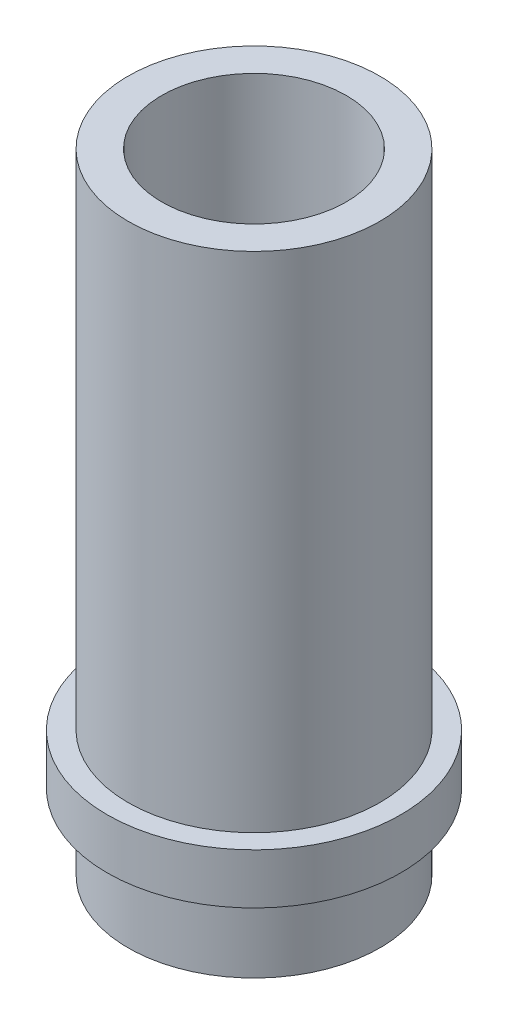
ISO-10303-21;
HEADER;
FILE_DESCRIPTION(('STEP AP214'),'2;1');
FILE_NAME('part.step','',(''),(''),'','','');
FILE_SCHEMA(('AUTOMOTIVE_DESIGN { 1 0 10303 214 1 1 1 1 }'));
ENDSEC;
DATA;
#1=APPLICATION_CONTEXT('core data for automotive mechanical design processes');
#2=APPLICATION_PROTOCOL_DEFINITION('international standard','automotive_design',2000,#1);
#3=PRODUCT_CONTEXT('',#1,'mechanical');
#4=PRODUCT('Part','Part','',(#3));
#5=PRODUCT_RELATED_PRODUCT_CATEGORY('part','',(#4));
#6=PRODUCT_DEFINITION_FORMATION('','',#4);
#7=PRODUCT_DEFINITION_CONTEXT('part definition',#1,'design');
#8=PRODUCT_DEFINITION('design','',#6,#7);
#9=PRODUCT_DEFINITION_SHAPE('','',#8);
#10=(LENGTH_UNIT() NAMED_UNIT(*) SI_UNIT(.MILLI.,.METRE.));
#11=(NAMED_UNIT(*) PLANE_ANGLE_UNIT() SI_UNIT($,.RADIAN.));
#12=(NAMED_UNIT(*) SI_UNIT($,.STERADIAN.) SOLID_ANGLE_UNIT());
#13=UNCERTAINTY_MEASURE_WITH_UNIT(LENGTH_MEASURE(1.E-05),#10,'distance_accuracy_value','');
#14=(GEOMETRIC_REPRESENTATION_CONTEXT(3) GLOBAL_UNCERTAINTY_ASSIGNED_CONTEXT((#13)) GLOBAL_UNIT_ASSIGNED_CONTEXT((#10,
#11,#12)) REPRESENTATION_CONTEXT('',''));
#15=CARTESIAN_POINT('',(0.,0.,0.));
#16=DIRECTION('',(0.,0.,1.));
#17=DIRECTION('',(1.,0.,0.));
#18=AXIS2_PLACEMENT_3D('',#15,#16,#17);
#19=CARTESIAN_POINT('',(-99.,0.,214.));
#20=DIRECTION('',(0.,-1.,0.));
#21=DIRECTION('',(0.,0.,-1.));
#22=AXIS2_PLACEMENT_3D('',#19,#20,#21);
#23=CYLINDRICAL_SURFACE('',#22,11.);
#24=CARTESIAN_POINT('',(-99.,0.,214.));
#25=DIRECTION('',(0.,-1.,0.));
#26=DIRECTION('',(0.,0.,-1.));
#27=AXIS2_PLACEMENT_3D('',#24,#25,#26);
#28=CIRCLE('',#27,11.);
#29=CARTESIAN_POINT('',(-99.,0.,203.));
#30=VERTEX_POINT('',#29);
#31=EDGE_CURVE('E26',#30,#30,#28,.T.);
#32=ORIENTED_EDGE('',*,*,#31,.F.);
#33=EDGE_LOOP('',(#32));
#34=FACE_BOUND('',#33,.T.);
#35=CARTESIAN_POINT('',(-99.,-75.,214.));
#36=DIRECTION('',(0.,-1.,0.));
#37=DIRECTION('',(0.,0.,-1.));
#38=AXIS2_PLACEMENT_3D('',#35,#36,#37);
#39=CIRCLE('',#38,11.);
#40=CARTESIAN_POINT('',(-99.,-75.,203.));
#41=VERTEX_POINT('',#40);
#42=EDGE_CURVE('E48',#41,#41,#39,.F.);
#43=ORIENTED_EDGE('',*,*,#42,.F.);
#44=EDGE_LOOP('',(#43));
#45=FACE_BOUND('',#44,.T.);
#46=ADVANCED_FACE('F22',(#34,#45),#23,.F.);
#47=CARTESIAN_POINT('',(-114.18,0.,229.18));
#48=DIRECTION('',(0.,1.,0.));
#49=DIRECTION('',(1.,0.,0.));
#50=AXIS2_PLACEMENT_3D('',#47,#48,#49);
#51=PLANE('',#50);
#52=ORIENTED_EDGE('',*,*,#31,.T.);
#53=EDGE_LOOP('',(#52));
#54=FACE_BOUND('',#53,.T.);
#55=CARTESIAN_POINT('',(-99.,0.,214.));
#56=DIRECTION('',(0.,1.,0.));
#57=DIRECTION('',(0.,0.,1.));
#58=AXIS2_PLACEMENT_3D('',#55,#56,#57);
#59=CIRCLE('',#58,15.);
#60=CARTESIAN_POINT('',(-99.,0.,229.));
#61=VERTEX_POINT('',#60);
#62=EDGE_CURVE('E46',#61,#61,#59,.T.);
#63=ORIENTED_EDGE('',*,*,#62,.T.);
#64=EDGE_LOOP('',(#63));
#65=FACE_BOUND('',#64,.T.);
#66=ADVANCED_FACE('F55',(#54,#65),#51,.T.);
#67=CARTESIAN_POINT('',(-83.82,-75.,229.18));
#68=DIRECTION('',(0.,-1.,0.));
#69=DIRECTION('',(-1.,0.,0.));
#70=AXIS2_PLACEMENT_3D('',#67,#68,#69);
#71=PLANE('',#70);
#72=ORIENTED_EDGE('',*,*,#42,.T.);
#73=EDGE_LOOP('',(#72));
#74=FACE_BOUND('',#73,.T.);
#75=CARTESIAN_POINT('',(-99.,-75.,214.));
#76=DIRECTION('',(0.,-1.,0.));
#77=DIRECTION('',(0.,0.,-1.));
#78=AXIS2_PLACEMENT_3D('',#75,#76,#77);
#79=CIRCLE('',#78,15.);
#80=CARTESIAN_POINT('',(-99.,-75.,199.));
#81=VERTEX_POINT('',#80);
#82=EDGE_CURVE('E43',#81,#81,#79,.T.);
#83=ORIENTED_EDGE('',*,*,#82,.T.);
#84=EDGE_LOOP('',(#83));
#85=FACE_BOUND('',#84,.T.);
#86=ADVANCED_FACE('F65',(#74,#85),#71,.T.);
#87=CARTESIAN_POINT('',(-99.,-60.,214.));
#88=DIRECTION('',(0.,1.,0.));
#89=DIRECTION('',(0.,0.,1.));
#90=AXIS2_PLACEMENT_3D('',#87,#88,#89);
#91=CYLINDRICAL_SURFACE('',#90,15.);
#92=ORIENTED_EDGE('',*,*,#62,.F.);
#93=EDGE_LOOP('',(#92));
#94=FACE_BOUND('',#93,.T.);
#95=CARTESIAN_POINT('',(-99.,-60.,214.));
#96=DIRECTION('',(0.,1.,0.));
#97=DIRECTION('',(0.,0.,1.));
#98=AXIS2_PLACEMENT_3D('',#95,#96,#97);
#99=CIRCLE('',#98,15.);
#100=CARTESIAN_POINT('',(-99.,-60.,229.));
#101=VERTEX_POINT('',#100);
#102=EDGE_CURVE('E40',#101,#101,#99,.F.);
#103=ORIENTED_EDGE('',*,*,#102,.F.);
#104=EDGE_LOOP('',(#103));
#105=FACE_BOUND('',#104,.T.);
#106=ADVANCED_FACE('F82',(#94,#105),#91,.T.);
#107=CARTESIAN_POINT('',(-99.,-66.,214.));
#108=DIRECTION('',(0.,-1.,0.));
#109=DIRECTION('',(0.,0.,-1.));
#110=AXIS2_PLACEMENT_3D('',#107,#108,#109);
#111=CYLINDRICAL_SURFACE('',#110,15.);
#112=ORIENTED_EDGE('',*,*,#82,.F.);
#113=EDGE_LOOP('',(#112));
#114=FACE_BOUND('',#113,.T.);
#115=CARTESIAN_POINT('',(-99.,-66.,214.));
#116=DIRECTION('',(0.,-1.,0.));
#117=DIRECTION('',(0.,0.,-1.));
#118=AXIS2_PLACEMENT_3D('',#115,#116,#117);
#119=CIRCLE('',#118,15.);
#120=CARTESIAN_POINT('',(-99.,-66.,199.));
#121=VERTEX_POINT('',#120);
#122=EDGE_CURVE('E35',#121,#121,#119,.F.);
#123=ORIENTED_EDGE('',*,*,#122,.F.);
#124=EDGE_LOOP('',(#123));
#125=FACE_BOUND('',#124,.T.);
#126=ADVANCED_FACE('F80',(#114,#125),#111,.T.);
#127=CARTESIAN_POINT('',(-116.71,-60.,231.71));
#128=DIRECTION('',(0.,1.,0.));
#129=DIRECTION('',(1.,0.,0.));
#130=AXIS2_PLACEMENT_3D('',#127,#128,#129);
#131=PLANE('',#130);
#132=ORIENTED_EDGE('',*,*,#102,.T.);
#133=EDGE_LOOP('',(#132));
#134=FACE_BOUND('',#133,.T.);
#135=CARTESIAN_POINT('',(-99.,-60.,214.));
#136=DIRECTION('',(0.,1.,0.));
#137=DIRECTION('',(0.,0.,1.));
#138=AXIS2_PLACEMENT_3D('',#135,#136,#137);
#139=CIRCLE('',#138,17.5);
#140=CARTESIAN_POINT('',(-99.,-60.,231.5));
#141=VERTEX_POINT('',#140);
#142=EDGE_CURVE('E30',#141,#141,#139,.T.);
#143=ORIENTED_EDGE('',*,*,#142,.T.);
#144=EDGE_LOOP('',(#143));
#145=FACE_BOUND('',#144,.T.);
#146=ADVANCED_FACE('F75',(#134,#145),#131,.T.);
#147=CARTESIAN_POINT('',(-81.29,-66.,231.71));
#148=DIRECTION('',(0.,-1.,0.));
#149=DIRECTION('',(-1.,0.,0.));
#150=AXIS2_PLACEMENT_3D('',#147,#148,#149);
#151=PLANE('',#150);
#152=ORIENTED_EDGE('',*,*,#122,.T.);
#153=EDGE_LOOP('',(#152));
#154=FACE_BOUND('',#153,.T.);
#155=CARTESIAN_POINT('',(-99.,-66.,214.));
#156=DIRECTION('',(0.,1.,0.));
#157=DIRECTION('',(0.,0.,1.));
#158=AXIS2_PLACEMENT_3D('',#155,#156,#157);
#159=CIRCLE('',#158,17.5);
#160=CARTESIAN_POINT('',(-99.,-66.,231.5));
#161=VERTEX_POINT('',#160);
#162=EDGE_CURVE('E12',#161,#161,#159,.F.);
#163=ORIENTED_EDGE('',*,*,#162,.T.);
#164=EDGE_LOOP('',(#163));
#165=FACE_BOUND('',#164,.T.);
#166=ADVANCED_FACE('F24',(#154,#165),#151,.T.);
#167=CARTESIAN_POINT('',(-99.,-66.,214.));
#168=DIRECTION('',(0.,1.,0.));
#169=DIRECTION('',(0.,0.,1.));
#170=AXIS2_PLACEMENT_3D('',#167,#168,#169);
#171=CYLINDRICAL_SURFACE('',#170,17.5);
#172=ORIENTED_EDGE('',*,*,#142,.F.);
#173=EDGE_LOOP('',(#172));
#174=FACE_BOUND('',#173,.T.);
#175=ORIENTED_EDGE('',*,*,#162,.F.);
#176=EDGE_LOOP('',(#175));
#177=FACE_BOUND('',#176,.T.);
#178=ADVANCED_FACE('F68',(#174,#177),#171,.T.);
#179=CLOSED_SHELL('',(#46,#66,#86,#106,#126,#146,#166,#178));
#180=MANIFOLD_SOLID_BREP('B1',#179);
#181=ADVANCED_BREP_SHAPE_REPRESENTATION('',(#18,#180),#14);
#182=SHAPE_DEFINITION_REPRESENTATION(#9,#181);
ENDSEC;
END-ISO-10303-21;
